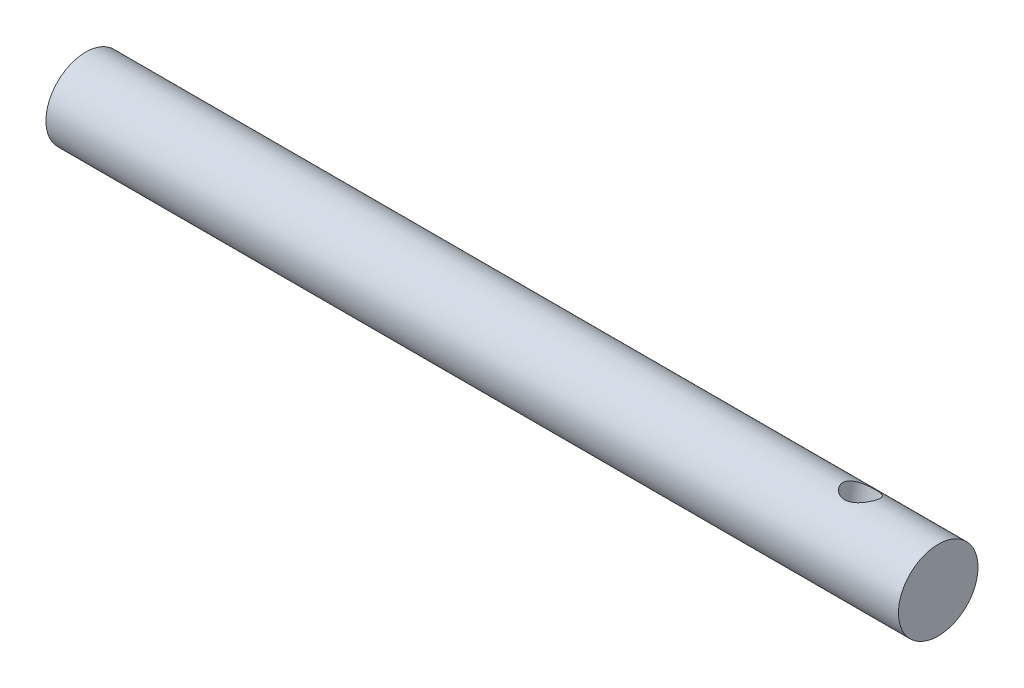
from build123d import *

# Parameters (mm, degrees)
SKETCH1_R                                  = 10.668
BOSS_EXTRUDE3_DEPTH                        = 228.6
F_97_0_0059_DIAMETER_HOLE1_D               = 12.7
F_97_0_0059_DIAMETER_HOLE1_DEPTH           = 226.06
F_97_0_0059_DIAMETER_HOLE2_D               = 8.466666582
F_97_0_0059_DIAMETER_HOLE2_DEPTH           = 6.35
F_97_0_0059_DIAMETER_HOLE3_D               = 8.466666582
F_97_0_0059_DIAMETER_HOLE3_DEPTH           = 6.35
F_97_0_0059_DIAMETER_HOLE3_ON_FACE_2_D     = 8.466666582
F_97_0_0059_DIAMETER_HOLE3_ON_FACE_2_DEPTH = 6.35
F_97_0_0059_DIAMETER_HOLE3_ON_FACE_3_D     = 8.466666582
F_97_0_0059_DIAMETER_HOLE3_ON_FACE_3_DEPTH = 6.35
F_97_0_0059_DIAMETER_HOLE3_ON_FACE_4_D     = 8.466666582
F_97_0_0059_DIAMETER_HOLE3_ON_FACE_4_DEPTH = 6.35
F_97_0_0059_DIAMETER_HOLE3_ON_FACE_5_D     = 8.466666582
F_97_0_0059_DIAMETER_HOLE3_ON_FACE_5_DEPTH = 6.35


with BuildPart() as part:
    # Sketch1 → Boss-Extrude3 (new body)
    with BuildSketch(Plane(origin=(0, 0, 0), x_dir=(0, 0, -1), z_dir=(1, 0, 0))):
        with Locations((-31.686126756, 21.587331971)):
            Circle(SKETCH1_R)
    extrude(amount=BOSS_EXTRUDE3_DEPTH)

    # 97 _0.0059_ Diameter Hole1
    with Locations(Plane.ZY):
        with Locations((31.686126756, 21.587331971)):
            Hole(F_97_0_0059_DIAMETER_HOLE1_D / 2, depth=F_97_0_0059_DIAMETER_HOLE1_DEPTH)

    # 97 _0.0059_ Diameter Hole2
    with Locations(Plane(origin=(205.548887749, 32.007407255, 29.399588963), x_dir=(0, 0.214336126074, 0.976759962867), z_dir=(0, 0.976759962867, -0.214336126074))):
        with Locations((0, 0)):
            Hole(F_97_0_0059_DIAMETER_HOLE2_D / 2, depth=F_97_0_0059_DIAMETER_HOLE2_DEPTH)

    # 97 _0.0059_ Diameter Hole3
    with Locations(Plane(origin=(16.392350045, 10.921205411, 31.886047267), x_dir=(0, -0.018740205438, -0.99982438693), z_dir=(0, -0.99982438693, 0.018740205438))):
        with Locations((0, 0)):
            Hole(F_97_0_0059_DIAMETER_HOLE3_D / 2, depth=F_97_0_0059_DIAMETER_HOLE3_DEPTH)

    # 97 _0.0059_ Diameter Hole3 on face 2
    with Locations(Plane(origin=(46.869727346, 10.921205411, 31.486206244), x_dir=(0, 0.018740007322, -0.999824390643), z_dir=(0, -0.999824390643, -0.018740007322))):
        with Locations((0, 0)):
            Hole(F_97_0_0059_DIAMETER_HOLE3_ON_FACE_2_D / 2, depth=F_97_0_0059_DIAMETER_HOLE3_ON_FACE_2_DEPTH)

    # 97 _0.0059_ Diameter Hole3 on face 3
    with Locations(Plane(origin=(78.609651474, 10.936204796, 32.285888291), x_dir=(0, -0.056221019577, -0.998418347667), z_dir=(0, -0.998418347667, 0.056221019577))):
        with Locations((0, 0)):
            Hole(F_97_0_0059_DIAMETER_HOLE3_ON_FACE_3_D / 2, depth=F_97_0_0059_DIAMETER_HOLE3_ON_FACE_3_DEPTH)

    # 97 _0.0059_ Diameter Hole3 on face 4
    with Locations(Plane(origin=(115.420112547, 10.936204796, 31.086365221), x_dir=(0, 0.056221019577, -0.998418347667), z_dir=(0, -0.998418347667, -0.056221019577))):
        with Locations((0, 0)):
            Hole(F_97_0_0059_DIAMETER_HOLE3_ON_FACE_4_D / 2, depth=F_97_0_0059_DIAMETER_HOLE3_ON_FACE_4_DEPTH)

    # 97 _0.0059_ Diameter Hole3 on face 5
    with Locations(Plane(origin=(153.511644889, 11.011520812, 30.286683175), x_dir=(0, 0.131181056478, -0.991358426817), z_dir=(0, -0.991358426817, -0.131181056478))):
        with Locations((0, 0)):
            Hole(F_97_0_0059_DIAMETER_HOLE3_ON_FACE_5_D / 2, depth=F_97_0_0059_DIAMETER_HOLE3_ON_FACE_5_DEPTH)


solid = part.part
